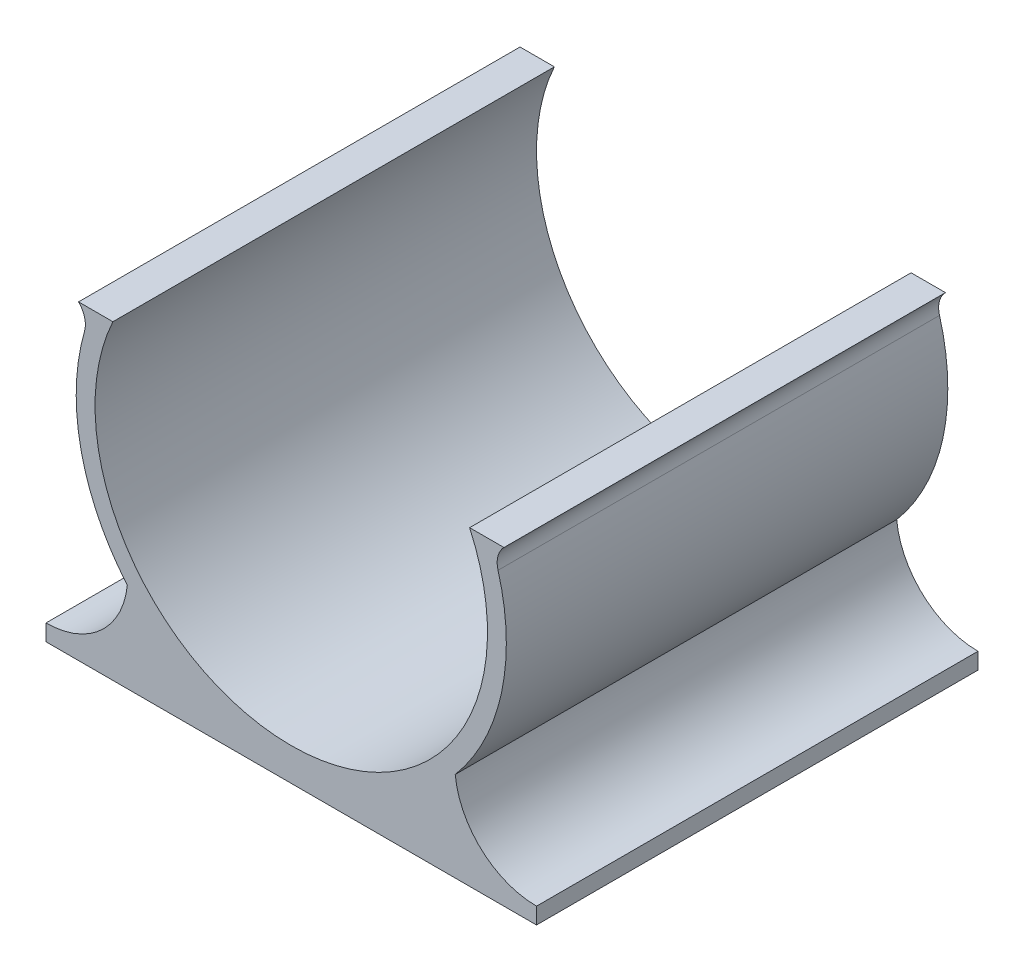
ISO-10303-21;
HEADER;
FILE_DESCRIPTION(('STEP AP214'),'2;1');
FILE_NAME('part.step','',(''),(''),'','','');
FILE_SCHEMA(('AUTOMOTIVE_DESIGN { 1 0 10303 214 1 1 1 1 }'));
ENDSEC;
DATA;
#1=APPLICATION_CONTEXT('core data for automotive mechanical design processes');
#2=APPLICATION_PROTOCOL_DEFINITION('international standard','automotive_design',2000,#1);
#3=PRODUCT_CONTEXT('',#1,'mechanical');
#4=PRODUCT('Part','Part','',(#3));
#5=PRODUCT_RELATED_PRODUCT_CATEGORY('part','',(#4));
#6=PRODUCT_DEFINITION_FORMATION('','',#4);
#7=PRODUCT_DEFINITION_CONTEXT('part definition',#1,'design');
#8=PRODUCT_DEFINITION('design','',#6,#7);
#9=PRODUCT_DEFINITION_SHAPE('','',#8);
#10=(LENGTH_UNIT() NAMED_UNIT(*) SI_UNIT(.MILLI.,.METRE.));
#11=(NAMED_UNIT(*) PLANE_ANGLE_UNIT() SI_UNIT($,.RADIAN.));
#12=(NAMED_UNIT(*) SI_UNIT($,.STERADIAN.) SOLID_ANGLE_UNIT());
#13=UNCERTAINTY_MEASURE_WITH_UNIT(LENGTH_MEASURE(1.E-05),#10,'distance_accuracy_value','');
#14=(GEOMETRIC_REPRESENTATION_CONTEXT(3) GLOBAL_UNCERTAINTY_ASSIGNED_CONTEXT((#13)) GLOBAL_UNIT_ASSIGNED_CONTEXT((#10,
#11,#12)) REPRESENTATION_CONTEXT('',''));
#15=CARTESIAN_POINT('',(0.,0.,0.));
#16=DIRECTION('',(0.,0.,1.));
#17=DIRECTION('',(1.,0.,0.));
#18=AXIS2_PLACEMENT_3D('',#15,#16,#17);
#19=CARTESIAN_POINT('',(-15.,5.,0.));
#20=DIRECTION('',(0.,-1.,0.));
#21=DIRECTION('',(0.,0.,-1.));
#22=AXIS2_PLACEMENT_3D('',#19,#20,#21);
#23=PLANE('',#22);
#24=DIRECTION('',(1.,0.,0.));
#25=VECTOR('',#24,1.);
#26=CARTESIAN_POINT('',(-15.,5.,0.));
#27=LINE('',#26,#25);
#28=CARTESIAN_POINT('',(10.9087121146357,5.,0.));
#29=VERTEX_POINT('',#28);
#30=CARTESIAN_POINT('',(13.0098392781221,5.,0.));
#31=VERTEX_POINT('',#30);
#32=EDGE_CURVE('E135',#29,#31,#27,.T.);
#33=ORIENTED_EDGE('',*,*,#32,.F.);
#34=DIRECTION('',(0.,0.,1.));
#35=VECTOR('',#34,1.);
#36=CARTESIAN_POINT('',(10.9087121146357,5.,27.));
#37=LINE('',#36,#35);
#38=CARTESIAN_POINT('',(10.9087121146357,5.,27.));
#39=VERTEX_POINT('',#38);
#40=EDGE_CURVE('E44',#29,#39,#37,.T.);
#41=ORIENTED_EDGE('',*,*,#40,.T.);
#42=DIRECTION('',(-1.,0.,0.));
#43=VECTOR('',#42,1.);
#44=CARTESIAN_POINT('',(15.,5.,27.));
#45=LINE('',#44,#43);
#46=CARTESIAN_POINT('',(13.0098392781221,5.,27.));
#47=VERTEX_POINT('',#46);
#48=EDGE_CURVE('E137',#47,#39,#45,.T.);
#49=ORIENTED_EDGE('',*,*,#48,.F.);
#50=DIRECTION('',(0.,0.,-1.));
#51=VECTOR('',#50,1.);
#52=CARTESIAN_POINT('',(13.0098392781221,5.,27.001));
#53=LINE('',#52,#51);
#54=EDGE_CURVE('E222',#47,#31,#53,.T.);
#55=ORIENTED_EDGE('',*,*,#54,.T.);
#56=EDGE_LOOP('',(#33,#41,#49,#55));
#57=FACE_BOUND('',#56,.T.);
#58=ADVANCED_FACE('F30',(#57),#23,.F.);
#59=CARTESIAN_POINT('',(-15.,5.,27.));
#60=DIRECTION('',(-1.,0.,0.));
#61=DIRECTION('',(0.,0.,1.));
#62=AXIS2_PLACEMENT_3D('',#59,#60,#61);
#63=PLANE('',#62);
#64=DIRECTION('',(0.,0.,-1.));
#65=VECTOR('',#64,1.);
#66=CARTESIAN_POINT('',(-15.,-13.,27.001));
#67=LINE('',#66,#65);
#68=CARTESIAN_POINT('',(-15.,-13.,27.));
#69=VERTEX_POINT('',#68);
#70=CARTESIAN_POINT('',(-15.,-13.,0.));
#71=VERTEX_POINT('',#70);
#72=EDGE_CURVE('E158',#69,#71,#67,.T.);
#73=ORIENTED_EDGE('',*,*,#72,.T.);
#74=DIRECTION('',(0.,-1.,0.));
#75=VECTOR('',#74,1.);
#76=CARTESIAN_POINT('',(-15.,5.,0.));
#77=LINE('',#76,#75);
#78=CARTESIAN_POINT('',(-15.,-14.,0.));
#79=VERTEX_POINT('',#78);
#80=EDGE_CURVE('E144',#71,#79,#77,.T.);
#81=ORIENTED_EDGE('',*,*,#80,.T.);
#82=DIRECTION('',(0.,0.,-1.));
#83=VECTOR('',#82,1.);
#84=CARTESIAN_POINT('',(-15.,-14.,27.));
#85=LINE('',#84,#83);
#86=CARTESIAN_POINT('',(-15.,-14.,27.));
#87=VERTEX_POINT('',#86);
#88=EDGE_CURVE('E156',#87,#79,#85,.T.);
#89=ORIENTED_EDGE('',*,*,#88,.F.);
#90=DIRECTION('',(0.,-1.,0.));
#91=VECTOR('',#90,1.);
#92=CARTESIAN_POINT('',(-15.,5.,27.));
#93=LINE('',#92,#91);
#94=EDGE_CURVE('E38',#69,#87,#93,.T.);
#95=ORIENTED_EDGE('',*,*,#94,.F.);
#96=EDGE_LOOP('',(#73,#81,#89,#95));
#97=FACE_BOUND('',#96,.T.);
#98=ADVANCED_FACE('F32',(#97),#63,.T.);
#99=CARTESIAN_POINT('',(15.,5.,27.));
#100=DIRECTION('',(0.,0.,1.));
#101=DIRECTION('',(1.,0.,0.));
#102=AXIS2_PLACEMENT_3D('',#99,#100,#101);
#103=PLANE('',#102);
#104=CARTESIAN_POINT('',(0.,0.,27.));
#105=DIRECTION('',(0.,0.,1.));
#106=DIRECTION('',(1.,0.,0.));
#107=AXIS2_PLACEMENT_3D('',#104,#105,#106);
#108=CIRCLE('',#107,12.);
#109=CARTESIAN_POINT('',(-10.9087121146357,5.,27.));
#110=VERTEX_POINT('',#109);
#111=EDGE_CURVE('E128',#110,#39,#108,.T.);
#112=ORIENTED_EDGE('',*,*,#111,.F.);
#113=CARTESIAN_POINT('',(-13.0098392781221,5.,27.));
#114=VERTEX_POINT('',#113);
#115=EDGE_CURVE('E52',#110,#114,#45,.T.);
#116=ORIENTED_EDGE('',*,*,#115,.T.);
#117=CARTESIAN_POINT('',(-14.,4.,27.));
#118=DIRECTION('',(0.,0.,1.));
#119=DIRECTION('',(1.,0.,0.));
#120=AXIS2_PLACEMENT_3D('',#117,#118,#119);
#121=CIRCLE('',#120,1.40727334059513);
#122=CARTESIAN_POINT('',(-12.6468729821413,3.61339228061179,27.));
#123=VERTEX_POINT('',#122);
#124=EDGE_CURVE('E187',#114,#123,#121,.F.);
#125=ORIENTED_EDGE('',*,*,#124,.T.);
#126=CARTESIAN_POINT('',(0.,0.,27.));
#127=DIRECTION('',(0.,0.,1.));
#128=DIRECTION('',(1.,0.,0.));
#129=AXIS2_PLACEMENT_3D('',#126,#127,#128);
#130=CIRCLE('',#129,13.1529464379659);
#131=CARTESIAN_POINT('',(-10.0263887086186,-8.51302117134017,27.));
#132=VERTEX_POINT('',#131);
#133=EDGE_CURVE('E184',#123,#132,#130,.T.);
#134=ORIENTED_EDGE('',*,*,#133,.T.);
#135=CARTESIAN_POINT('',(-15.,-8.,27.));
#136=DIRECTION('',(0.,0.,1.));
#137=DIRECTION('',(1.,0.,0.));
#138=AXIS2_PLACEMENT_3D('',#135,#136,#137);
#139=CIRCLE('',#138,5.);
#140=EDGE_CURVE('E183',#132,#69,#139,.F.);
#141=ORIENTED_EDGE('',*,*,#140,.T.);
#142=ORIENTED_EDGE('',*,*,#94,.T.);
#143=DIRECTION('',(-1.,0.,0.));
#144=VECTOR('',#143,1.);
#145=CARTESIAN_POINT('',(15.,-14.,27.));
#146=LINE('',#145,#144);
#147=CARTESIAN_POINT('',(15.,-14.,27.));
#148=VERTEX_POINT('',#147);
#149=EDGE_CURVE('E139',#148,#87,#146,.T.);
#150=ORIENTED_EDGE('',*,*,#149,.F.);
#151=DIRECTION('',(0.,-1.,0.));
#152=VECTOR('',#151,1.);
#153=CARTESIAN_POINT('',(15.,5.,27.));
#154=LINE('',#153,#152);
#155=CARTESIAN_POINT('',(15.,-13.,27.));
#156=VERTEX_POINT('',#155);
#157=EDGE_CURVE('E146',#156,#148,#154,.T.);
#158=ORIENTED_EDGE('',*,*,#157,.F.);
#159=CARTESIAN_POINT('',(15.,-8.,27.));
#160=DIRECTION('',(0.,0.,1.));
#161=DIRECTION('',(1.,0.,0.));
#162=AXIS2_PLACEMENT_3D('',#159,#160,#161);
#163=CIRCLE('',#162,5.);
#164=CARTESIAN_POINT('',(10.0263887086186,-8.51302117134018,27.));
#165=VERTEX_POINT('',#164);
#166=EDGE_CURVE('E209',#156,#165,#163,.F.);
#167=ORIENTED_EDGE('',*,*,#166,.T.);
#168=CARTESIAN_POINT('',(0.,0.,27.));
#169=DIRECTION('',(0.,0.,1.));
#170=DIRECTION('',(1.,0.,0.));
#171=AXIS2_PLACEMENT_3D('',#168,#169,#170);
#172=CIRCLE('',#171,13.1529464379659);
#173=CARTESIAN_POINT('',(12.6468729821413,3.6133922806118,27.));
#174=VERTEX_POINT('',#173);
#175=EDGE_CURVE('E171',#165,#174,#172,.T.);
#176=ORIENTED_EDGE('',*,*,#175,.T.);
#177=CARTESIAN_POINT('',(14.,4.,27.));
#178=DIRECTION('',(0.,0.,1.));
#179=DIRECTION('',(1.,0.,0.));
#180=AXIS2_PLACEMENT_3D('',#177,#178,#179);
#181=CIRCLE('',#180,1.40727334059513);
#182=EDGE_CURVE('E206',#174,#47,#181,.F.);
#183=ORIENTED_EDGE('',*,*,#182,.T.);
#184=ORIENTED_EDGE('',*,*,#48,.T.);
#185=EDGE_LOOP('',(#112,#116,#125,#134,#141,#142,#150,#158,#167,#176,#183,#184));
#186=FACE_BOUND('',#185,.T.);
#187=ADVANCED_FACE('F179',(#186),#103,.T.);
#188=CARTESIAN_POINT('',(15.,5.,0.));
#189=DIRECTION('',(1.,0.,0.));
#190=DIRECTION('',(0.,0.,-1.));
#191=AXIS2_PLACEMENT_3D('',#188,#189,#190);
#192=PLANE('',#191);
#193=DIRECTION('',(0.,0.,-1.));
#194=VECTOR('',#193,1.);
#195=CARTESIAN_POINT('',(15.,-13.,27.001));
#196=LINE('',#195,#194);
#197=CARTESIAN_POINT('',(15.,-13.,0.));
#198=VERTEX_POINT('',#197);
#199=EDGE_CURVE('E174',#156,#198,#196,.T.);
#200=ORIENTED_EDGE('',*,*,#199,.F.);
#201=ORIENTED_EDGE('',*,*,#157,.T.);
#202=DIRECTION('',(0.,0.,1.));
#203=VECTOR('',#202,1.);
#204=CARTESIAN_POINT('',(15.,-14.,0.));
#205=LINE('',#204,#203);
#206=CARTESIAN_POINT('',(15.,-14.,0.));
#207=VERTEX_POINT('',#206);
#208=EDGE_CURVE('E167',#207,#148,#205,.T.);
#209=ORIENTED_EDGE('',*,*,#208,.F.);
#210=DIRECTION('',(0.,-1.,0.));
#211=VECTOR('',#210,1.);
#212=CARTESIAN_POINT('',(15.,5.,0.));
#213=LINE('',#212,#211);
#214=EDGE_CURVE('E148',#198,#207,#213,.T.);
#215=ORIENTED_EDGE('',*,*,#214,.F.);
#216=EDGE_LOOP('',(#200,#201,#209,#215));
#217=FACE_BOUND('',#216,.T.);
#218=ADVANCED_FACE('F239',(#217),#192,.T.);
#219=CARTESIAN_POINT('',(-15.,5.,0.));
#220=DIRECTION('',(0.,0.,-1.));
#221=DIRECTION('',(-1.,0.,0.));
#222=AXIS2_PLACEMENT_3D('',#219,#220,#221);
#223=PLANE('',#222);
#224=CARTESIAN_POINT('',(0.,0.,0.));
#225=DIRECTION('',(0.,0.,-1.));
#226=DIRECTION('',(-1.,0.,0.));
#227=AXIS2_PLACEMENT_3D('',#224,#225,#226);
#228=CIRCLE('',#227,12.);
#229=CARTESIAN_POINT('',(-10.9087121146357,5.,0.));
#230=VERTEX_POINT('',#229);
#231=EDGE_CURVE('E11',#29,#230,#228,.T.);
#232=ORIENTED_EDGE('',*,*,#231,.F.);
#233=ORIENTED_EDGE('',*,*,#32,.T.);
#234=CARTESIAN_POINT('',(14.,4.,0.));
#235=DIRECTION('',(0.,0.,-1.));
#236=DIRECTION('',(-1.,0.,0.));
#237=AXIS2_PLACEMENT_3D('',#234,#235,#236);
#238=CIRCLE('',#237,1.40727334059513);
#239=CARTESIAN_POINT('',(12.6468729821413,3.6133922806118,0.));
#240=VERTEX_POINT('',#239);
#241=EDGE_CURVE('E217',#240,#31,#238,.T.);
#242=ORIENTED_EDGE('',*,*,#241,.F.);
#243=CARTESIAN_POINT('',(0.,0.,0.));
#244=DIRECTION('',(0.,0.,1.));
#245=DIRECTION('',(1.,0.,0.));
#246=AXIS2_PLACEMENT_3D('',#243,#244,#245);
#247=CIRCLE('',#246,13.1529464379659);
#248=CARTESIAN_POINT('',(10.0263887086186,-8.51302117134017,0.));
#249=VERTEX_POINT('',#248);
#250=EDGE_CURVE('E214',#249,#240,#247,.T.);
#251=ORIENTED_EDGE('',*,*,#250,.F.);
#252=CARTESIAN_POINT('',(15.,-8.,0.));
#253=DIRECTION('',(0.,0.,-1.));
#254=DIRECTION('',(-1.,0.,0.));
#255=AXIS2_PLACEMENT_3D('',#252,#253,#254);
#256=CIRCLE('',#255,5.);
#257=EDGE_CURVE('E211',#198,#249,#256,.T.);
#258=ORIENTED_EDGE('',*,*,#257,.F.);
#259=ORIENTED_EDGE('',*,*,#214,.T.);
#260=DIRECTION('',(1.,0.,0.));
#261=VECTOR('',#260,1.);
#262=CARTESIAN_POINT('',(-15.,-14.,0.));
#263=LINE('',#262,#261);
#264=EDGE_CURVE('E161',#79,#207,#263,.T.);
#265=ORIENTED_EDGE('',*,*,#264,.F.);
#266=ORIENTED_EDGE('',*,*,#80,.F.);
#267=CARTESIAN_POINT('',(-15.,-8.,0.));
#268=DIRECTION('',(0.,0.,-1.));
#269=DIRECTION('',(-1.,0.,0.));
#270=AXIS2_PLACEMENT_3D('',#267,#268,#269);
#271=CIRCLE('',#270,5.);
#272=CARTESIAN_POINT('',(-10.0263887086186,-8.51302117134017,0.));
#273=VERTEX_POINT('',#272);
#274=EDGE_CURVE('E196',#273,#71,#271,.T.);
#275=ORIENTED_EDGE('',*,*,#274,.F.);
#276=CARTESIAN_POINT('',(0.,0.,0.));
#277=DIRECTION('',(0.,0.,1.));
#278=DIRECTION('',(1.,0.,0.));
#279=AXIS2_PLACEMENT_3D('',#276,#277,#278);
#280=CIRCLE('',#279,13.1529464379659);
#281=CARTESIAN_POINT('',(-12.6468729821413,3.61339228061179,0.));
#282=VERTEX_POINT('',#281);
#283=EDGE_CURVE('E193',#282,#273,#280,.T.);
#284=ORIENTED_EDGE('',*,*,#283,.F.);
#285=CARTESIAN_POINT('',(-14.,4.,0.));
#286=DIRECTION('',(0.,0.,-1.));
#287=DIRECTION('',(-1.,0.,0.));
#288=AXIS2_PLACEMENT_3D('',#285,#286,#287);
#289=CIRCLE('',#288,1.40727334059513);
#290=CARTESIAN_POINT('',(-13.0098392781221,5.,0.));
#291=VERTEX_POINT('',#290);
#292=EDGE_CURVE('E134',#291,#282,#289,.T.);
#293=ORIENTED_EDGE('',*,*,#292,.F.);
#294=EDGE_CURVE('E127',#291,#230,#27,.T.);
#295=ORIENTED_EDGE('',*,*,#294,.T.);
#296=EDGE_LOOP('',(#232,#233,#242,#251,#258,#259,#265,#266,#275,#284,#293,#295));
#297=FACE_BOUND('',#296,.T.);
#298=ADVANCED_FACE('F131',(#297),#223,.T.);
#299=ORIENTED_EDGE('',*,*,#115,.F.);
#300=DIRECTION('',(0.,0.,1.));
#301=VECTOR('',#300,1.);
#302=CARTESIAN_POINT('',(-10.9087121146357,5.,27.));
#303=LINE('',#302,#301);
#304=EDGE_CURVE('E119',#110,#230,#303,.F.);
#305=ORIENTED_EDGE('',*,*,#304,.T.);
#306=ORIENTED_EDGE('',*,*,#294,.F.);
#307=DIRECTION('',(0.,0.,-1.));
#308=VECTOR('',#307,1.);
#309=CARTESIAN_POINT('',(-13.0098392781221,5.,27.001));
#310=LINE('',#309,#308);
#311=EDGE_CURVE('E199',#114,#291,#310,.T.);
#312=ORIENTED_EDGE('',*,*,#311,.F.);
#313=EDGE_LOOP('',(#299,#305,#306,#312));
#314=FACE_BOUND('',#313,.T.);
#315=ADVANCED_FACE('F125',(#314),#23,.F.);
#316=CARTESIAN_POINT('',(-15.,-14.,0.));
#317=DIRECTION('',(0.,-1.,0.));
#318=DIRECTION('',(0.,0.,-1.));
#319=AXIS2_PLACEMENT_3D('',#316,#317,#318);
#320=PLANE('',#319);
#321=ORIENTED_EDGE('',*,*,#88,.T.);
#322=ORIENTED_EDGE('',*,*,#264,.T.);
#323=ORIENTED_EDGE('',*,*,#208,.T.);
#324=ORIENTED_EDGE('',*,*,#149,.T.);
#325=EDGE_LOOP('',(#321,#322,#323,#324));
#326=FACE_BOUND('',#325,.T.);
#327=ADVANCED_FACE('F169',(#326),#320,.T.);
#328=CARTESIAN_POINT('',(15.,-8.,27.001));
#329=DIRECTION('',(0.,0.,-1.));
#330=DIRECTION('',(-1.,0.,0.));
#331=AXIS2_PLACEMENT_3D('',#328,#329,#330);
#332=CYLINDRICAL_SURFACE('',#331,5.);
#333=ORIENTED_EDGE('',*,*,#199,.T.);
#334=ORIENTED_EDGE('',*,*,#257,.T.);
#335=DIRECTION('',(0.,0.,-1.));
#336=VECTOR('',#335,1.);
#337=CARTESIAN_POINT('',(10.0263887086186,-8.51302117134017,27.001));
#338=LINE('',#337,#336);
#339=EDGE_CURVE('E220',#165,#249,#338,.T.);
#340=ORIENTED_EDGE('',*,*,#339,.F.);
#341=ORIENTED_EDGE('',*,*,#166,.F.);
#342=EDGE_LOOP('',(#333,#334,#340,#341));
#343=FACE_BOUND('',#342,.T.);
#344=ADVANCED_FACE('F233',(#343),#332,.F.);
#345=CARTESIAN_POINT('',(14.,4.,27.001));
#346=DIRECTION('',(0.,0.,-1.));
#347=DIRECTION('',(-1.,0.,0.));
#348=AXIS2_PLACEMENT_3D('',#345,#346,#347);
#349=CYLINDRICAL_SURFACE('',#348,1.40727334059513);
#350=DIRECTION('',(0.,0.,-1.));
#351=VECTOR('',#350,1.);
#352=CARTESIAN_POINT('',(12.6468729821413,3.6133922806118,27.001));
#353=LINE('',#352,#351);
#354=EDGE_CURVE('E225',#174,#240,#353,.T.);
#355=ORIENTED_EDGE('',*,*,#354,.T.);
#356=ORIENTED_EDGE('',*,*,#241,.T.);
#357=ORIENTED_EDGE('',*,*,#54,.F.);
#358=ORIENTED_EDGE('',*,*,#182,.F.);
#359=EDGE_LOOP('',(#355,#356,#357,#358));
#360=FACE_BOUND('',#359,.T.);
#361=ADVANCED_FACE('F236',(#360),#349,.F.);
#362=CARTESIAN_POINT('',(0.,0.,27.001));
#363=DIRECTION('',(0.,0.,-1.));
#364=DIRECTION('',(-1.,0.,0.));
#365=AXIS2_PLACEMENT_3D('',#362,#363,#364);
#366=CYLINDRICAL_SURFACE('',#365,13.1529464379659);
#367=ORIENTED_EDGE('',*,*,#339,.T.);
#368=ORIENTED_EDGE('',*,*,#250,.T.);
#369=ORIENTED_EDGE('',*,*,#354,.F.);
#370=ORIENTED_EDGE('',*,*,#175,.F.);
#371=EDGE_LOOP('',(#367,#368,#369,#370));
#372=FACE_BOUND('',#371,.T.);
#373=ADVANCED_FACE('F228',(#372),#366,.T.);
#374=CARTESIAN_POINT('',(-14.,4.,27.001));
#375=DIRECTION('',(0.,0.,-1.));
#376=DIRECTION('',(-1.,0.,0.));
#377=AXIS2_PLACEMENT_3D('',#374,#375,#376);
#378=CYLINDRICAL_SURFACE('',#377,1.40727334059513);
#379=ORIENTED_EDGE('',*,*,#311,.T.);
#380=ORIENTED_EDGE('',*,*,#292,.T.);
#381=DIRECTION('',(0.,0.,-1.));
#382=VECTOR('',#381,1.);
#383=CARTESIAN_POINT('',(-12.6468729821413,3.61339228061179,27.001));
#384=LINE('',#383,#382);
#385=EDGE_CURVE('E198',#123,#282,#384,.T.);
#386=ORIENTED_EDGE('',*,*,#385,.F.);
#387=ORIENTED_EDGE('',*,*,#124,.F.);
#388=EDGE_LOOP('',(#379,#380,#386,#387));
#389=FACE_BOUND('',#388,.T.);
#390=ADVANCED_FACE('F264',(#389),#378,.F.);
#391=CARTESIAN_POINT('',(-15.,-8.,27.001));
#392=DIRECTION('',(0.,0.,-1.));
#393=DIRECTION('',(-1.,0.,0.));
#394=AXIS2_PLACEMENT_3D('',#391,#392,#393);
#395=CYLINDRICAL_SURFACE('',#394,5.);
#396=DIRECTION('',(0.,0.,-1.));
#397=VECTOR('',#396,1.);
#398=CARTESIAN_POINT('',(-10.0263887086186,-8.51302117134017,27.001));
#399=LINE('',#398,#397);
#400=EDGE_CURVE('E202',#132,#273,#399,.T.);
#401=ORIENTED_EDGE('',*,*,#400,.T.);
#402=ORIENTED_EDGE('',*,*,#274,.T.);
#403=ORIENTED_EDGE('',*,*,#72,.F.);
#404=ORIENTED_EDGE('',*,*,#140,.F.);
#405=EDGE_LOOP('',(#401,#402,#403,#404));
#406=FACE_BOUND('',#405,.T.);
#407=ADVANCED_FACE('F269',(#406),#395,.F.);
#408=CARTESIAN_POINT('',(0.,0.,27.001));
#409=DIRECTION('',(0.,0.,-1.));
#410=DIRECTION('',(-1.,0.,0.));
#411=AXIS2_PLACEMENT_3D('',#408,#409,#410);
#412=CYLINDRICAL_SURFACE('',#411,13.1529464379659);
#413=ORIENTED_EDGE('',*,*,#385,.T.);
#414=ORIENTED_EDGE('',*,*,#283,.T.);
#415=ORIENTED_EDGE('',*,*,#400,.F.);
#416=ORIENTED_EDGE('',*,*,#133,.F.);
#417=EDGE_LOOP('',(#413,#414,#415,#416));
#418=FACE_BOUND('',#417,.T.);
#419=ADVANCED_FACE('F271',(#418),#412,.T.);
#420=CARTESIAN_POINT('',(0.,0.,27.));
#421=DIRECTION('',(0.,0.,1.));
#422=DIRECTION('',(1.,0.,0.));
#423=AXIS2_PLACEMENT_3D('',#420,#421,#422);
#424=CYLINDRICAL_SURFACE('',#423,12.);
#425=ORIENTED_EDGE('',*,*,#231,.T.);
#426=ORIENTED_EDGE('',*,*,#304,.F.);
#427=ORIENTED_EDGE('',*,*,#111,.T.);
#428=ORIENTED_EDGE('',*,*,#40,.F.);
#429=EDGE_LOOP('',(#425,#426,#427,#428));
#430=FACE_BOUND('',#429,.T.);
#431=ADVANCED_FACE('F118',(#430),#424,.F.);
#432=CLOSED_SHELL('',(#58,#98,#187,#218,#298,#315,#327,#344,#361,#373,#390,#407,#419,#431));
#433=MANIFOLD_SOLID_BREP('B2',#432);
#434=ADVANCED_BREP_SHAPE_REPRESENTATION('',(#18,#433),#14);
#435=SHAPE_DEFINITION_REPRESENTATION(#9,#434);
ENDSEC;
END-ISO-10303-21;
